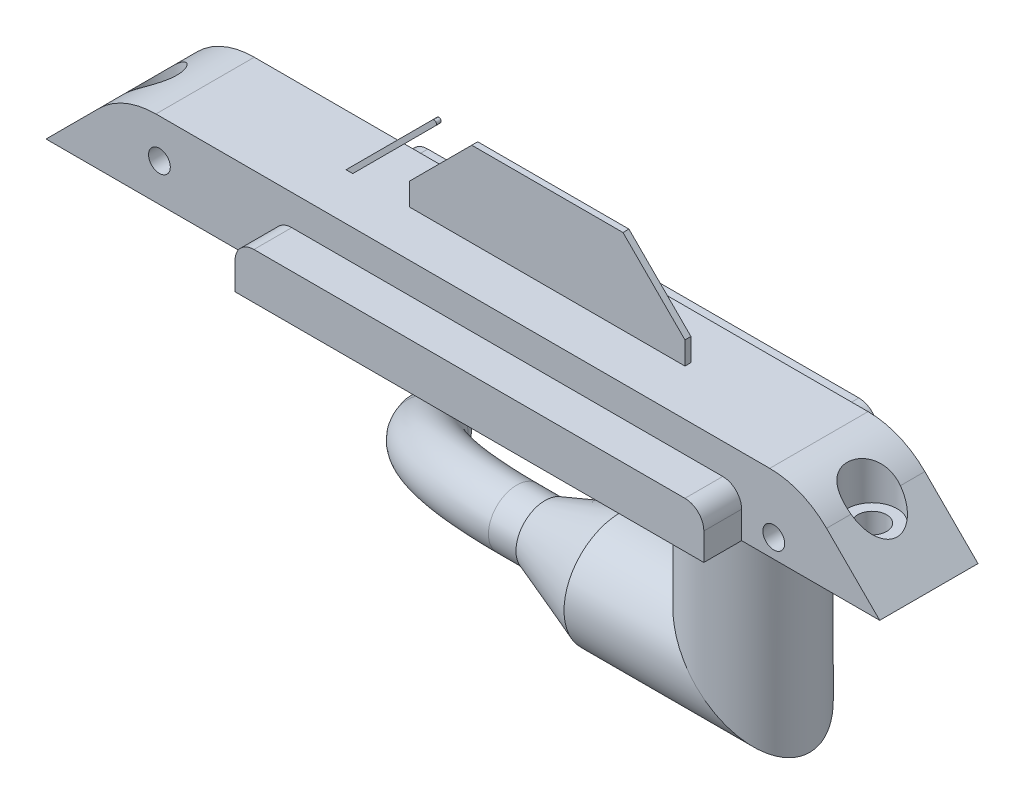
from build123d import *
from build123d.topology import SkipClean

# Parameters (mm, degrees)
SKETCH1_W                                      = 140.0302
SKETCH1_H                                      = 16.51
EXTRUDE1_DEPTH                                 = 12.8778
EXTRUDE2_DEPTH                                 = 0.396875
EXTRUDE5_DEPTH                                 = 119.78715622
EXTRUDE5_DEPTH_BACK                            = 119.78715622
FILLET3_R                                      = 13.49375
CBORE_FOR_8_SOCKET_HEAD_CAP_SCREW1_D           = 4.8768
CBORE_FOR_8_SOCKET_HEAD_CAP_SCREW1_CBORE_D     = 8.382
CBORE_FOR_8_SOCKET_HEAD_CAP_SCREW1_CBORE_DEPTH = 7.62
BLADE_DEPTH                                    = 0.5
EXTRUDE9_DEPTH                                 = 14.605
F_27_0_144_DIAMETER_HOLE1_D                    = 3.6576
SKETCH10_R                                     = 9.525
EXTRUDE7_DEPTH                                 = 33.3375
BOSS_EXTRUDE1_START                            = -4.7625
SKETCH16_R                                     = 9.525
BOSS_EXTRUDE1_DEPTH                            = 22.225
CUT_EXTRUDE1_DEPTH                             = 96.486372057
SKETCH11_R                                     = 9.525
EXTRUDE8_DEPTH                                 = 12.7
EXTRUDE8_DRAFT                                 = -20
SKETCH18_R                                     = 4.7625
BOSS_EXTRUDE2_DEPTH                            = 4.7625
SKETCH19_R                                     = 4.7625
REVOLVE1_ANGLE                                 = 57
SKETCH20_R                                     = 4.7625
BOSS_EXTRUDE3_DEPTH                            = 3.175


with BuildPart() as part:
    # Sketch1 → Extrude1 (new body)
    with BuildSketch(Plane(origin=(0, 0, 0), x_dir=(1, 0, 0), z_dir=(0, 1, 0))):
        with Locations((-45.2501, 0)):
            Rectangle(SKETCH1_W, SKETCH1_H)
    extrude(amount=EXTRUDE1_DEPTH)

    # Sketch2 → Extrude2 (add, symmetric)
    with BuildSketch(Plane.XY):
        with BuildLine():
            Line((-72.7202, 12.8778), (-72.158933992, 12.316533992))
            Line((-72.158933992, 12.316533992), (-57.654300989, 26.821166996))
            ThreePointArc((-57.654300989, 26.821166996), (-57.654300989, 27.382433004), (-58.215566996, 27.382433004))
            Line((-58.215566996, 27.382433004), (-72.7202, 12.8778))
        make_face()
    extrude(amount=EXTRUDE2_DEPTH, both=True)

    # Sketch7 → Extrude5 (cut, two sides: drawn at the far end of the back side and taken through both)
    with BuildSketch(Plane.XY.offset(-EXTRUDE5_DEPTH_BACK)):
        Polygon((11.8872, 12.8778), (24.765, 0), (24.765, 12.8778), align=None)
        Polygon((-102.3874, 12.8778), (-115.2652, 12.8778), (-115.2652, 0), align=None)
    extrude(amount=EXTRUDE5_DEPTH + EXTRUDE5_DEPTH_BACK, mode=Mode.SUBTRACT)

    # Fillet3
    fillet3_edges = [part.edges().sort_by_distance(p)[0] for p in [
        (11.8872, 12.8778, 0),
        (-102.3874, 12.8778, 0),
    ]]
    fillet(fillet3_edges, radius=FILLET3_R)

    # CBORE for _8 Socket Head Cap Screw1 (through all)
    with Locations(Plane(origin=(0, 12.8778, 0), x_dir=(-1, 0, 0), z_dir=(0, 1, 0))):
        with Locations((105.7402, 0), (-15.24, 0)):
            CounterBoreHole(CBORE_FOR_8_SOCKET_HEAD_CAP_SCREW1_D / 2, CBORE_FOR_8_SOCKET_HEAD_CAP_SCREW1_CBORE_D / 2, CBORE_FOR_8_SOCKET_HEAD_CAP_SCREW1_CBORE_DEPTH)

    # Sketch12 → Blade (add, symmetric)
    with BuildSketch(Plane.XY):
        Polygon((-15.6972, 16.6878), (-26.1112, 27.1018), (-51.5112, 27.1018), (-61.9252, 16.6878), (-61.9252, 12.8778), (-15.6972, 12.8778), align=None)
    extrude(amount=BLADE_DEPTH, both=True)

    # Sketch13 → Extrude9 (add, symmetric)
    with BuildSketch(Plane.XY):
        with BuildLine():
            Line((-77.1652, 0), (-77.1652, 4.572))
            ThreePointArc((-77.1652, 4.572), (-76.23526403, 6.81706403), (-73.9902, 7.747))
            Line((-73.9902, 7.747), (-1.6002, 7.747))
            ThreePointArc((-1.6002, 7.747), (0.64486403, 6.81706403), (1.5748, 4.572))
            Line((1.5748, 4.572), (1.5748, 0))
            Line((1.5748, 0), (-77.1652, 0))
        make_face()
    extrude(amount=EXTRUDE9_DEPTH, both=True)

    # 27 _0.144_ Diameter Hole1 (through all)
    with Locations(Plane(origin=(0, 0, -8.255), x_dir=(-1, 0, 0), z_dir=(0, 0, -1))):
        with Locations((-6.9723, 3.175), (96.2152, 6.35)):
            Hole(F_27_0_144_DIAMETER_HOLE1_D / 2)

    # Sketch10 → Extrude7 (add)
    with BuildSketch(Plane.XZ):
        with Locations(Location((-4.7625, 0, 0), (0, 0, 90))):
            Circle(SKETCH10_R)
    extrude(amount=EXTRUDE7_DEPTH)

    # Sketch16 → Boss-Extrude1 (add)
    with SkipClean():  # the faces are left unmerged after this step: merging them gives an invalid solid
        with BuildSketch(Plane(origin=(0, 0, 0), x_dir=(0, 0, -1), z_dir=(1, 0, 0)).offset(BOSS_EXTRUDE1_START)):
            with Locations((0, -23.8125)):
                Circle(SKETCH16_R)
        extrude(amount=-BOSS_EXTRUDE1_DEPTH)

    # Sketch17 → Cut-Extrude1 (cut, through all)
    with BuildSketch(Plane.ZY.offset(26.9875)):
        with BuildLine():
            Line((9.525, -23.8125), (10.910270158, -23.8125))
            Line((10.910270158, -23.8125), (10.910270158, -38.080194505))
            Line((10.910270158, -38.080194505), (-13.26617866, -37.689786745))
            Line((-13.26617866, -37.689786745), (-13.26617866, -23.8125))
            Line((-13.26617866, -23.8125), (-9.525, -23.8125))
            ThreePointArc((-9.525, -23.8125), (0, -33.3375), (9.525, -23.8125))
        make_face()
    extrude(amount=-CUT_EXTRUDE1_DEPTH, mode=Mode.SUBTRACT)


with BuildPart() as extrude8_tool:
    # Sketch11 → Extrude8 (with draft: the straight prism first)
    with BuildSketch(Plane(origin=(-26.9875, -13.208, 0), x_dir=(0, 1, 0), z_dir=(1, 0, 0))):
        with Locations(Location((-10.6045, 0, 0), (0, 0, 270))):
            Circle(SKETCH11_R)
    extrude(amount=-EXTRUDE8_DEPTH)
    # Extrude8: the draft: its side faces are tilted about the plane it starts from
    extrude8_sides = [extrude8_tool.faces().sort_by_distance(p)[0] for p in [
        (-33.3375, -23.8125, 9.525),
    ]]
    draft(extrude8_sides, Plane(origin=(-26.9875, -13.208, 0), x_dir=(0, 1, 0), z_dir=(1, 0, 0)), EXTRUDE8_DRAFT)


with BuildPart() as part_1:
    add(part.part)

    # Extrude8: add extrude8_tool
    add(extrude8_tool.part)

    # Sketch18 → Boss-Extrude2 (add)
    with BuildSketch(Plane.ZY.offset(39.6875)):
        with Locations(Location((0, -23.8125, 0), (0, 0, 180))):
            Circle(SKETCH18_R)
    extrude(amount=BOSS_EXTRUDE2_DEPTH)

    # Sketch19 → Revolve1 (revolve)
    with BuildSketch(Plane.ZY.offset(44.45)):
        with Locations(Location((0, -23.8125, 0), (0, 0, 180))):
            Circle(SKETCH19_R)
    revolve(axis=Axis((-44.45, -23.8125, -38.649579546), (0, -0.849141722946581, 0.5281650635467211)), revolution_arc=REVOLVE1_ANGLE)

    # Sketch20 → Boss-Extrude3 (add)
    with BuildSketch(Plane(origin=(-33.92088775, -27.587955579, -44.353717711), x_dir=(-0.7030156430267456, -0.22189469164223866, 0.6756713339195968), z_dir=(-0.5446390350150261, -0.4429564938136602, -0.7121501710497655))):
        with Locations(Location((49.060122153, 7.791961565, 0), (0, 0, 33.044212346))):
            Circle(SKETCH20_R)
    extrude(amount=BOSS_EXTRUDE3_DEPTH)


solid = part_1.part
